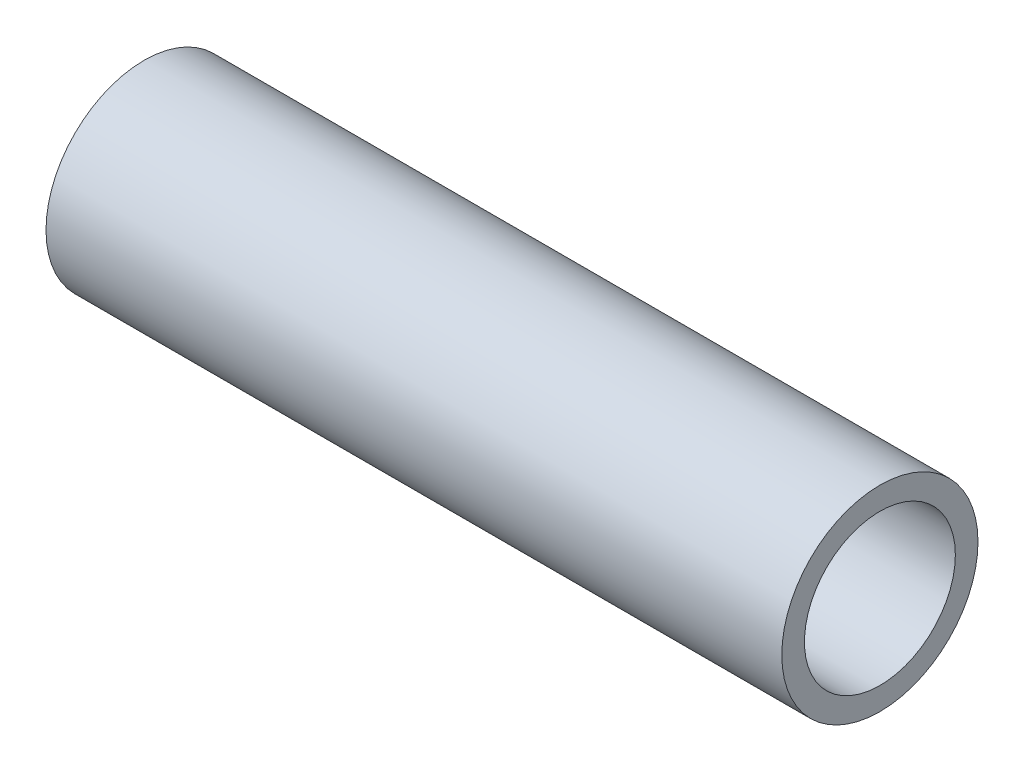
ISO-10303-21;
HEADER;
FILE_DESCRIPTION(('STEP AP214'),'2;1');
FILE_NAME('part.step','',(''),(''),'','','');
FILE_SCHEMA(('AUTOMOTIVE_DESIGN { 1 0 10303 214 1 1 1 1 }'));
ENDSEC;
DATA;
#1=APPLICATION_CONTEXT('core data for automotive mechanical design processes');
#2=APPLICATION_PROTOCOL_DEFINITION('international standard','automotive_design',2000,#1);
#3=PRODUCT_CONTEXT('',#1,'mechanical');
#4=PRODUCT('Part','Part','',(#3));
#5=PRODUCT_RELATED_PRODUCT_CATEGORY('part','',(#4));
#6=PRODUCT_DEFINITION_FORMATION('','',#4);
#7=PRODUCT_DEFINITION_CONTEXT('part definition',#1,'design');
#8=PRODUCT_DEFINITION('design','',#6,#7);
#9=PRODUCT_DEFINITION_SHAPE('','',#8);
#10=(LENGTH_UNIT() NAMED_UNIT(*) SI_UNIT(.MILLI.,.METRE.));
#11=(NAMED_UNIT(*) PLANE_ANGLE_UNIT() SI_UNIT($,.RADIAN.));
#12=(NAMED_UNIT(*) SI_UNIT($,.STERADIAN.) SOLID_ANGLE_UNIT());
#13=UNCERTAINTY_MEASURE_WITH_UNIT(LENGTH_MEASURE(1.E-05),#10,'distance_accuracy_value','');
#14=(GEOMETRIC_REPRESENTATION_CONTEXT(3) GLOBAL_UNCERTAINTY_ASSIGNED_CONTEXT((#13)) GLOBAL_UNIT_ASSIGNED_CONTEXT((#10,
#11,#12)) REPRESENTATION_CONTEXT('',''));
#15=CARTESIAN_POINT('',(0.,0.,0.));
#16=DIRECTION('',(0.,0.,1.));
#17=DIRECTION('',(1.,0.,0.));
#18=AXIS2_PLACEMENT_3D('',#15,#16,#17);
#19=CARTESIAN_POINT('',(123.825,0.,0.));
#20=DIRECTION('',(-1.,0.,0.));
#21=DIRECTION('',(0.,0.,1.));
#22=AXIS2_PLACEMENT_3D('',#19,#20,#21);
#23=CYLINDRICAL_SURFACE('',#22,12.7);
#24=CARTESIAN_POINT('',(123.825,0.,0.));
#25=DIRECTION('',(1.,0.,0.));
#26=DIRECTION('',(0.,0.,-1.));
#27=AXIS2_PLACEMENT_3D('',#24,#25,#26);
#28=CIRCLE('',#27,12.7);
#29=CARTESIAN_POINT('',(123.825,0.,-12.7));
#30=VERTEX_POINT('',#29);
#31=EDGE_CURVE('E53',#30,#30,#28,.T.);
#32=ORIENTED_EDGE('',*,*,#31,.T.);
#33=EDGE_LOOP('',(#32));
#34=FACE_BOUND('',#33,.T.);
#35=CARTESIAN_POINT('',(0.,0.,0.));
#36=DIRECTION('',(1.,0.,0.));
#37=DIRECTION('',(0.,0.,-1.));
#38=AXIS2_PLACEMENT_3D('',#35,#36,#37);
#39=CIRCLE('',#38,12.7);
#40=CARTESIAN_POINT('',(0.,0.,-12.7));
#41=VERTEX_POINT('',#40);
#42=EDGE_CURVE('E60',#41,#41,#39,.T.);
#43=ORIENTED_EDGE('',*,*,#42,.F.);
#44=EDGE_LOOP('',(#43));
#45=FACE_BOUND('',#44,.T.);
#46=ADVANCED_FACE('F45',(#34,#45),#23,.F.);
#47=CARTESIAN_POINT('',(123.825,0.,0.));
#48=DIRECTION('',(-1.,0.,0.));
#49=DIRECTION('',(0.,0.,1.));
#50=AXIS2_PLACEMENT_3D('',#47,#48,#49);
#51=CYLINDRICAL_SURFACE('',#50,16.51);
#52=CARTESIAN_POINT('',(123.825,0.,0.));
#53=DIRECTION('',(1.,0.,0.));
#54=DIRECTION('',(0.,0.,-1.));
#55=AXIS2_PLACEMENT_3D('',#52,#53,#54);
#56=CIRCLE('',#55,16.51);
#57=CARTESIAN_POINT('',(123.825,0.,-16.51));
#58=VERTEX_POINT('',#57);
#59=EDGE_CURVE('E10',#58,#58,#56,.T.);
#60=ORIENTED_EDGE('',*,*,#59,.F.);
#61=EDGE_LOOP('',(#60));
#62=FACE_BOUND('',#61,.T.);
#63=CARTESIAN_POINT('',(0.,0.,0.));
#64=DIRECTION('',(1.,0.,0.));
#65=DIRECTION('',(0.,0.,-1.));
#66=AXIS2_PLACEMENT_3D('',#63,#64,#65);
#67=CIRCLE('',#66,16.51);
#68=CARTESIAN_POINT('',(0.,0.,-16.51));
#69=VERTEX_POINT('',#68);
#70=EDGE_CURVE('E48',#69,#69,#67,.T.);
#71=ORIENTED_EDGE('',*,*,#70,.T.);
#72=EDGE_LOOP('',(#71));
#73=FACE_BOUND('',#72,.T.);
#74=ADVANCED_FACE('F69',(#62,#73),#51,.T.);
#75=CARTESIAN_POINT('',(123.825,0.,0.));
#76=DIRECTION('',(1.,0.,0.));
#77=DIRECTION('',(0.,0.,-1.));
#78=AXIS2_PLACEMENT_3D('',#75,#76,#77);
#79=PLANE('',#78);
#80=ORIENTED_EDGE('',*,*,#31,.F.);
#81=EDGE_LOOP('',(#80));
#82=FACE_BOUND('',#81,.T.);
#83=ORIENTED_EDGE('',*,*,#59,.T.);
#84=EDGE_LOOP('',(#83));
#85=FACE_BOUND('',#84,.T.);
#86=ADVANCED_FACE('F73',(#82,#85),#79,.T.);
#87=CARTESIAN_POINT('',(0.,0.,0.));
#88=DIRECTION('',(1.,0.,0.));
#89=DIRECTION('',(0.,0.,-1.));
#90=AXIS2_PLACEMENT_3D('',#87,#88,#89);
#91=PLANE('',#90);
#92=ORIENTED_EDGE('',*,*,#42,.T.);
#93=EDGE_LOOP('',(#92));
#94=FACE_BOUND('',#93,.T.);
#95=ORIENTED_EDGE('',*,*,#70,.F.);
#96=EDGE_LOOP('',(#95));
#97=FACE_BOUND('',#96,.T.);
#98=ADVANCED_FACE('F71',(#94,#97),#91,.F.);
#99=CLOSED_SHELL('',(#46,#74,#86,#98));
#100=MANIFOLD_SOLID_BREP('B2',#99);
#101=ADVANCED_BREP_SHAPE_REPRESENTATION('',(#18,#100),#14);
#102=SHAPE_DEFINITION_REPRESENTATION(#9,#101);
ENDSEC;
END-ISO-10303-21;
